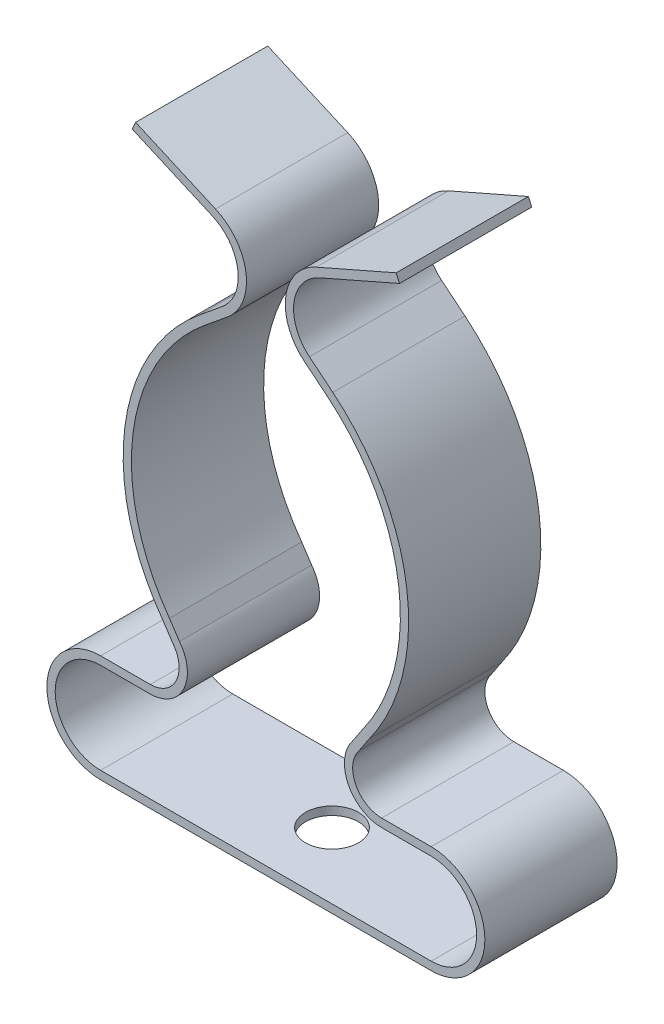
from build123d import *

# Parameters (mm, degrees)
ESQUISSE2_W             = 8
ESQUISSE2_H             = 0.5
ESQUISSE3_R             = 1.6
ENL_V_MAT_EXTRU_1_DEPTH = 2


with BuildPart() as part:
    # Balayage1: sweep along a path in Esquisse1
    with BuildLine(Plane.XY) as balayage1_path:
        Line((0, 0), (10, 0))
        ThreePointArc((10, 0), (13, 3), (10, 6))
        Line((10, 6), (7, 6))
        ThreePointArc((7, 6), (5.200232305, 7.127740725), (5.430135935, 9.239163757))
        Line((5.430135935, 9.239163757), (6.040901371, 10.157373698))
        ThreePointArc((6.040901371, 10.157373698), (8.285565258, 18.948126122), (3.889921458, 26.885012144))
        Line((3.889921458, 26.885012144), (2.476852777, 28.044474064))
        ThreePointArc((2.476852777, 28.044474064), (1.450152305, 30.665038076), (3.146974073, 32.910537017))
        Line((3.146974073, 32.910537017), (7.985422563, 35.033227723))
    # Esquisse2 → Balayage1 (sweep)
    with BuildSketch(Plane(origin=(0, 0, 0), x_dir=(0, 0, -1), z_dir=(1, 0, 0))):
        Rectangle(ESQUISSE2_W, ESQUISSE2_H)
    balayage1 = sweep(path=balayage1_path.line, transition=Transition.RIGHT)

    # Sym_trie1: Balayage1 across plane
    add(balayage1.mirror(Plane(origin=(0, -0.25, 4), x_dir=(0, 0, 1), z_dir=(1, 0, 0))))

    # Esquisse3 → Enl_v. mat.-Extru.1 (cut)
    with BuildSketch(Plane(origin=(0, 0.25, 0), x_dir=(-1, 0, 0), z_dir=(0, 1, 0))):
        Circle(ESQUISSE3_R)
    extrude(amount=-ENL_V_MAT_EXTRU_1_DEPTH, mode=Mode.SUBTRACT)


solid = part.part
